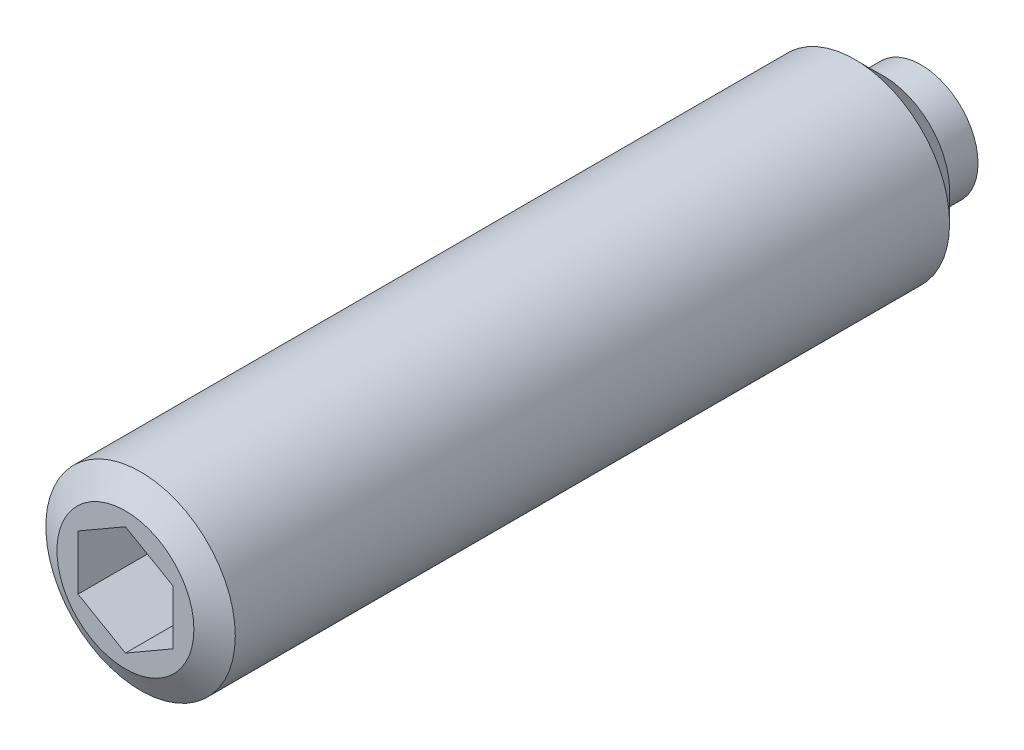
ISO-10303-21;
HEADER;
FILE_DESCRIPTION(('STEP AP214'),'2;1');
FILE_NAME('part.step','',(''),(''),'','','');
FILE_SCHEMA(('AUTOMOTIVE_DESIGN { 1 0 10303 214 1 1 1 1 }'));
ENDSEC;
DATA;
#1=APPLICATION_CONTEXT('core data for automotive mechanical design processes');
#2=APPLICATION_PROTOCOL_DEFINITION('international standard','automotive_design',2000,#1);
#3=PRODUCT_CONTEXT('',#1,'mechanical');
#4=PRODUCT('Part','Part','',(#3));
#5=PRODUCT_RELATED_PRODUCT_CATEGORY('part','',(#4));
#6=PRODUCT_DEFINITION_FORMATION('','',#4);
#7=PRODUCT_DEFINITION_CONTEXT('part definition',#1,'design');
#8=PRODUCT_DEFINITION('design','',#6,#7);
#9=PRODUCT_DEFINITION_SHAPE('','',#8);
#10=(LENGTH_UNIT() NAMED_UNIT(*) SI_UNIT(.MILLI.,.METRE.));
#11=(NAMED_UNIT(*) PLANE_ANGLE_UNIT() SI_UNIT($,.RADIAN.));
#12=(NAMED_UNIT(*) SI_UNIT($,.STERADIAN.) SOLID_ANGLE_UNIT());
#13=UNCERTAINTY_MEASURE_WITH_UNIT(LENGTH_MEASURE(1.E-05),#10,'distance_accuracy_value','');
#14=(GEOMETRIC_REPRESENTATION_CONTEXT(3) GLOBAL_UNCERTAINTY_ASSIGNED_CONTEXT((#13)) GLOBAL_UNIT_ASSIGNED_CONTEXT((#10,
#11,#12)) REPRESENTATION_CONTEXT('',''));
#15=CARTESIAN_POINT('',(0.,0.,0.));
#16=DIRECTION('',(0.,0.,1.));
#17=DIRECTION('',(1.,0.,0.));
#18=AXIS2_PLACEMENT_3D('',#15,#16,#17);
#19=CARTESIAN_POINT('',(3.,0.,0.));
#20=DIRECTION('',(0.,0.,-1.));
#21=DIRECTION('',(-1.,0.,0.));
#22=AXIS2_PLACEMENT_3D('',#19,#20,#21);
#23=PLANE('',#22);
#24=CARTESIAN_POINT('',(0.,0.,0.));
#25=DIRECTION('',(0.,0.,1.));
#26=DIRECTION('',(1.,0.,0.));
#27=AXIS2_PLACEMENT_3D('',#24,#25,#26);
#28=CIRCLE('',#27,3.);
#29=CARTESIAN_POINT('',(3.,0.,0.));
#30=VERTEX_POINT('',#29);
#31=EDGE_CURVE('E124',#30,#30,#28,.T.);
#32=ORIENTED_EDGE('',*,*,#31,.F.);
#33=EDGE_LOOP('',(#32));
#34=FACE_BOUND('',#33,.T.);
#35=ADVANCED_FACE('F14',(#34),#23,.T.);
#36=CARTESIAN_POINT('',(0.,0.,62.));
#37=DIRECTION('',(0.,0.,1.));
#38=DIRECTION('',(1.,0.,0.));
#39=AXIS2_PLACEMENT_3D('',#36,#37,#38);
#40=CYLINDRICAL_SURFACE('',#39,3.);
#41=CARTESIAN_POINT('',(0.,0.,2.));
#42=DIRECTION('',(0.,0.,1.));
#43=DIRECTION('',(1.,0.,0.));
#44=AXIS2_PLACEMENT_3D('',#41,#42,#43);
#45=CIRCLE('',#44,3.);
#46=CARTESIAN_POINT('',(3.,0.,2.));
#47=VERTEX_POINT('',#46);
#48=EDGE_CURVE('E121',#47,#47,#45,.T.);
#49=ORIENTED_EDGE('',*,*,#48,.F.);
#50=EDGE_LOOP('',(#49));
#51=FACE_BOUND('',#50,.T.);
#52=ORIENTED_EDGE('',*,*,#31,.T.);
#53=EDGE_LOOP('',(#52));
#54=FACE_BOUND('',#53,.T.);
#55=ADVANCED_FACE('F149',(#51,#54),#40,.T.);
#56=CARTESIAN_POINT('',(5.,0.,2.));
#57=DIRECTION('',(0.,0.,-1.));
#58=DIRECTION('',(-1.,0.,0.));
#59=AXIS2_PLACEMENT_3D('',#56,#57,#58);
#60=PLANE('',#59);
#61=CARTESIAN_POINT('',(0.,0.,2.));
#62=DIRECTION('',(0.,0.,-1.));
#63=DIRECTION('',(-1.,0.,0.));
#64=AXIS2_PLACEMENT_3D('',#61,#62,#63);
#65=CIRCLE('',#64,3.5);
#66=CARTESIAN_POINT('',(-3.5,0.,2.));
#67=VERTEX_POINT('',#66);
#68=EDGE_CURVE('E130',#67,#67,#65,.T.);
#69=ORIENTED_EDGE('',*,*,#68,.T.);
#70=EDGE_LOOP('',(#69));
#71=FACE_BOUND('',#70,.T.);
#72=ORIENTED_EDGE('',*,*,#48,.T.);
#73=EDGE_LOOP('',(#72));
#74=FACE_BOUND('',#73,.T.);
#75=ADVANCED_FACE('F155',(#71,#74),#60,.T.);
#76=CARTESIAN_POINT('',(0.,0.,62.));
#77=DIRECTION('',(0.,0.,1.));
#78=DIRECTION('',(1.,0.,0.));
#79=AXIS2_PLACEMENT_3D('',#76,#77,#78);
#80=CYLINDRICAL_SURFACE('',#79,5.);
#81=CARTESIAN_POINT('',(0.,0.,41.2));
#82=DIRECTION('',(0.,0.,1.));
#83=DIRECTION('',(1.,0.,0.));
#84=AXIS2_PLACEMENT_3D('',#81,#82,#83);
#85=CIRCLE('',#84,5.);
#86=CARTESIAN_POINT('',(5.,0.,41.2));
#87=VERTEX_POINT('',#86);
#88=EDGE_CURVE('E9',#87,#87,#85,.F.);
#89=ORIENTED_EDGE('',*,*,#88,.T.);
#90=EDGE_LOOP('',(#89));
#91=FACE_BOUND('',#90,.T.);
#92=CARTESIAN_POINT('',(0.,0.,3.5));
#93=DIRECTION('',(0.,0.,-1.));
#94=DIRECTION('',(-1.,0.,0.));
#95=AXIS2_PLACEMENT_3D('',#92,#93,#94);
#96=CIRCLE('',#95,5.);
#97=CARTESIAN_POINT('',(-5.,0.,3.5));
#98=VERTEX_POINT('',#97);
#99=EDGE_CURVE('E127',#98,#98,#96,.F.);
#100=ORIENTED_EDGE('',*,*,#99,.T.);
#101=EDGE_LOOP('',(#100));
#102=FACE_BOUND('',#101,.T.);
#103=ADVANCED_FACE('F162',(#91,#102),#80,.T.);
#104=CARTESIAN_POINT('',(0.,0.,42.));
#105=DIRECTION('',(0.,0.,1.));
#106=DIRECTION('',(1.,0.,0.));
#107=AXIS2_PLACEMENT_3D('',#104,#105,#106);
#108=PLANE('',#107);
#109=CARTESIAN_POINT('',(0.,0.,42.));
#110=DIRECTION('',(0.,0.,1.));
#111=DIRECTION('',(1.,0.,0.));
#112=AXIS2_PLACEMENT_3D('',#109,#110,#111);
#113=CIRCLE('',#112,3.61435935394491);
#114=CARTESIAN_POINT('',(3.61435935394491,0.,42.));
#115=VERTEX_POINT('',#114);
#116=EDGE_CURVE('E22',#115,#115,#113,.T.);
#117=ORIENTED_EDGE('',*,*,#116,.T.);
#118=EDGE_LOOP('',(#117));
#119=FACE_BOUND('',#118,.T.);
#120=DIRECTION('',(0.86602540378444,-0.5,0.));
#121=VECTOR('',#120,1.);
#122=CARTESIAN_POINT('',(-2.5,-1.44337567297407,42.));
#123=LINE('',#122,#121);
#124=CARTESIAN_POINT('',(-2.5,-1.44337567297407,42.));
#125=VERTEX_POINT('',#124);
#126=CARTESIAN_POINT('',(0.,-2.88675134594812,42.));
#127=VERTEX_POINT('',#126);
#128=EDGE_CURVE('E29',#125,#127,#123,.T.);
#129=ORIENTED_EDGE('',*,*,#128,.F.);
#130=DIRECTION('',(0.,-1.,0.));
#131=VECTOR('',#130,1.);
#132=CARTESIAN_POINT('',(-2.5,1.44337567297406,42.));
#133=LINE('',#132,#131);
#134=CARTESIAN_POINT('',(-2.5,1.44337567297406,42.));
#135=VERTEX_POINT('',#134);
#136=EDGE_CURVE('E97',#135,#125,#133,.T.);
#137=ORIENTED_EDGE('',*,*,#136,.F.);
#138=DIRECTION('',(0.866025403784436,0.5,0.));
#139=VECTOR('',#138,1.);
#140=CARTESIAN_POINT('',(-2.5,1.44337567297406,42.));
#141=LINE('',#140,#139);
#142=CARTESIAN_POINT('',(0.,2.88675134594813,42.));
#143=VERTEX_POINT('',#142);
#144=EDGE_CURVE('E92',#135,#143,#141,.T.);
#145=ORIENTED_EDGE('',*,*,#144,.T.);
#146=DIRECTION('',(-0.866025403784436,0.5,0.));
#147=VECTOR('',#146,1.);
#148=CARTESIAN_POINT('',(2.5,1.44337567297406,42.));
#149=LINE('',#148,#147);
#150=CARTESIAN_POINT('',(2.5,1.44337567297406,42.));
#151=VERTEX_POINT('',#150);
#152=EDGE_CURVE('E90',#151,#143,#149,.T.);
#153=ORIENTED_EDGE('',*,*,#152,.F.);
#154=DIRECTION('',(0.,-1.,0.));
#155=VECTOR('',#154,1.);
#156=CARTESIAN_POINT('',(2.5,1.44337567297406,42.));
#157=LINE('',#156,#155);
#158=CARTESIAN_POINT('',(2.5,-1.44337567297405,42.));
#159=VERTEX_POINT('',#158);
#160=EDGE_CURVE('E72',#151,#159,#157,.T.);
#161=ORIENTED_EDGE('',*,*,#160,.T.);
#162=DIRECTION('',(-0.866025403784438,-0.5,0.));
#163=VECTOR('',#162,1.);
#164=CARTESIAN_POINT('',(2.5,-1.44337567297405,42.));
#165=LINE('',#164,#163);
#166=EDGE_CURVE('E83',#159,#127,#165,.T.);
#167=ORIENTED_EDGE('',*,*,#166,.T.);
#168=EDGE_LOOP('',(#129,#137,#145,#153,#161,#167));
#169=FACE_BOUND('',#168,.T.);
#170=ADVANCED_FACE('F87',(#119,#169),#108,.T.);
#171=CARTESIAN_POINT('',(-2.5,-1.44337567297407,38.));
#172=DIRECTION('',(-0.5,-0.86602540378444,0.));
#173=DIRECTION('',(-0.86602540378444,0.5,0.));
#174=AXIS2_PLACEMENT_3D('',#171,#172,#173);
#175=PLANE('',#174);
#176=DIRECTION('',(0.,0.,1.));
#177=VECTOR('',#176,1.);
#178=CARTESIAN_POINT('',(-2.5,-1.44337567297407,38.));
#179=LINE('',#178,#177);
#180=CARTESIAN_POINT('',(-2.5,-1.44337567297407,38.));
#181=VERTEX_POINT('',#180);
#182=EDGE_CURVE('E36',#181,#125,#179,.T.);
#183=ORIENTED_EDGE('',*,*,#182,.T.);
#184=ORIENTED_EDGE('',*,*,#128,.T.);
#185=DIRECTION('',(0.,0.,1.));
#186=VECTOR('',#185,1.);
#187=CARTESIAN_POINT('',(0.,-2.88675134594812,38.));
#188=LINE('',#187,#186);
#189=CARTESIAN_POINT('',(0.,-2.88675134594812,38.));
#190=VERTEX_POINT('',#189);
#191=EDGE_CURVE('E80',#190,#127,#188,.T.);
#192=ORIENTED_EDGE('',*,*,#191,.F.);
#193=DIRECTION('',(0.86602540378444,-0.5,0.));
#194=VECTOR('',#193,1.);
#195=CARTESIAN_POINT('',(-2.5,-1.44337567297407,38.));
#196=LINE('',#195,#194);
#197=EDGE_CURVE('E99',#181,#190,#196,.T.);
#198=ORIENTED_EDGE('',*,*,#197,.F.);
#199=EDGE_LOOP('',(#183,#184,#192,#198));
#200=FACE_BOUND('',#199,.T.);
#201=ADVANCED_FACE('F169',(#200),#175,.F.);
#202=CARTESIAN_POINT('',(-2.5,1.44337567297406,38.));
#203=DIRECTION('',(-1.,0.,0.));
#204=DIRECTION('',(0.,1.,0.));
#205=AXIS2_PLACEMENT_3D('',#202,#203,#204);
#206=PLANE('',#205);
#207=DIRECTION('',(0.,0.,1.));
#208=VECTOR('',#207,1.);
#209=CARTESIAN_POINT('',(-2.5,1.44337567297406,38.));
#210=LINE('',#209,#208);
#211=CARTESIAN_POINT('',(-2.5,1.44337567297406,38.));
#212=VERTEX_POINT('',#211);
#213=EDGE_CURVE('E118',#212,#135,#210,.T.);
#214=ORIENTED_EDGE('',*,*,#213,.T.);
#215=ORIENTED_EDGE('',*,*,#136,.T.);
#216=ORIENTED_EDGE('',*,*,#182,.F.);
#217=DIRECTION('',(0.,-1.,0.));
#218=VECTOR('',#217,1.);
#219=CARTESIAN_POINT('',(-2.5,1.44337567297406,38.));
#220=LINE('',#219,#218);
#221=EDGE_CURVE('E111',#212,#181,#220,.T.);
#222=ORIENTED_EDGE('',*,*,#221,.F.);
#223=EDGE_LOOP('',(#214,#215,#216,#222));
#224=FACE_BOUND('',#223,.T.);
#225=ADVANCED_FACE('F170',(#224),#206,.F.);
#226=CARTESIAN_POINT('',(-2.5,1.44337567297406,38.));
#227=DIRECTION('',(0.5,-0.866025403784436,0.));
#228=DIRECTION('',(-0.866025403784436,-0.5,0.));
#229=AXIS2_PLACEMENT_3D('',#226,#227,#228);
#230=PLANE('',#229);
#231=DIRECTION('',(0.,0.,1.));
#232=VECTOR('',#231,1.);
#233=CARTESIAN_POINT('',(0.,2.88675134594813,38.));
#234=LINE('',#233,#232);
#235=CARTESIAN_POINT('',(0.,2.88675134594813,38.));
#236=VERTEX_POINT('',#235);
#237=EDGE_CURVE('E116',#236,#143,#234,.T.);
#238=ORIENTED_EDGE('',*,*,#237,.T.);
#239=ORIENTED_EDGE('',*,*,#144,.F.);
#240=ORIENTED_EDGE('',*,*,#213,.F.);
#241=DIRECTION('',(0.866025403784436,0.5,0.));
#242=VECTOR('',#241,1.);
#243=CARTESIAN_POINT('',(-2.5,1.44337567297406,38.));
#244=LINE('',#243,#242);
#245=EDGE_CURVE('E108',#212,#236,#244,.T.);
#246=ORIENTED_EDGE('',*,*,#245,.T.);
#247=EDGE_LOOP('',(#238,#239,#240,#246));
#248=FACE_BOUND('',#247,.T.);
#249=ADVANCED_FACE('F173',(#248),#230,.T.);
#250=CARTESIAN_POINT('',(2.5,1.44337567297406,38.));
#251=DIRECTION('',(0.5,0.866025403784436,0.));
#252=DIRECTION('',(0.866025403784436,-0.5,0.));
#253=AXIS2_PLACEMENT_3D('',#250,#251,#252);
#254=PLANE('',#253);
#255=DIRECTION('',(0.,0.,1.));
#256=VECTOR('',#255,1.);
#257=CARTESIAN_POINT('',(2.5,1.44337567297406,38.));
#258=LINE('',#257,#256);
#259=CARTESIAN_POINT('',(2.5,1.44337567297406,38.));
#260=VERTEX_POINT('',#259);
#261=EDGE_CURVE('E79',#260,#151,#258,.T.);
#262=ORIENTED_EDGE('',*,*,#261,.T.);
#263=ORIENTED_EDGE('',*,*,#152,.T.);
#264=ORIENTED_EDGE('',*,*,#237,.F.);
#265=DIRECTION('',(-0.866025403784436,0.5,0.));
#266=VECTOR('',#265,1.);
#267=CARTESIAN_POINT('',(2.5,1.44337567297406,38.));
#268=LINE('',#267,#266);
#269=EDGE_CURVE('E105',#260,#236,#268,.T.);
#270=ORIENTED_EDGE('',*,*,#269,.F.);
#271=EDGE_LOOP('',(#262,#263,#264,#270));
#272=FACE_BOUND('',#271,.T.);
#273=ADVANCED_FACE('F176',(#272),#254,.F.);
#274=CARTESIAN_POINT('',(2.5,1.44337567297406,38.));
#275=DIRECTION('',(-1.,0.,0.));
#276=DIRECTION('',(0.,1.,0.));
#277=AXIS2_PLACEMENT_3D('',#274,#275,#276);
#278=PLANE('',#277);
#279=DIRECTION('',(0.,0.,1.));
#280=VECTOR('',#279,1.);
#281=CARTESIAN_POINT('',(2.5,-1.44337567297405,38.));
#282=LINE('',#281,#280);
#283=CARTESIAN_POINT('',(2.5,-1.44337567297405,38.));
#284=VERTEX_POINT('',#283);
#285=EDGE_CURVE('E68',#284,#159,#282,.T.);
#286=ORIENTED_EDGE('',*,*,#285,.T.);
#287=ORIENTED_EDGE('',*,*,#160,.F.);
#288=ORIENTED_EDGE('',*,*,#261,.F.);
#289=DIRECTION('',(0.,-1.,0.));
#290=VECTOR('',#289,1.);
#291=CARTESIAN_POINT('',(2.5,1.44337567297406,38.));
#292=LINE('',#291,#290);
#293=EDGE_CURVE('E75',#260,#284,#292,.T.);
#294=ORIENTED_EDGE('',*,*,#293,.T.);
#295=EDGE_LOOP('',(#286,#287,#288,#294));
#296=FACE_BOUND('',#295,.T.);
#297=ADVANCED_FACE('F70',(#296),#278,.T.);
#298=CARTESIAN_POINT('',(2.5,-1.44337567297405,38.));
#299=DIRECTION('',(-0.5,0.866025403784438,0.));
#300=DIRECTION('',(0.866025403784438,0.5,0.));
#301=AXIS2_PLACEMENT_3D('',#298,#299,#300);
#302=PLANE('',#301);
#303=DIRECTION('',(-0.866025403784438,-0.5,0.));
#304=VECTOR('',#303,1.);
#305=CARTESIAN_POINT('',(2.5,-1.44337567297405,38.));
#306=LINE('',#305,#304);
#307=EDGE_CURVE('E102',#284,#190,#306,.T.);
#308=ORIENTED_EDGE('',*,*,#307,.T.);
#309=ORIENTED_EDGE('',*,*,#191,.T.);
#310=ORIENTED_EDGE('',*,*,#166,.F.);
#311=ORIENTED_EDGE('',*,*,#285,.F.);
#312=EDGE_LOOP('',(#308,#309,#310,#311));
#313=FACE_BOUND('',#312,.T.);
#314=ADVANCED_FACE('F84',(#313),#302,.T.);
#315=CARTESIAN_POINT('',(2.5,-4.33012701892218,38.));
#316=DIRECTION('',(0.,0.,-1.));
#317=DIRECTION('',(-1.,0.,0.));
#318=AXIS2_PLACEMENT_3D('',#315,#316,#317);
#319=PLANE('',#318);
#320=ORIENTED_EDGE('',*,*,#197,.T.);
#321=ORIENTED_EDGE('',*,*,#307,.F.);
#322=ORIENTED_EDGE('',*,*,#293,.F.);
#323=ORIENTED_EDGE('',*,*,#269,.T.);
#324=ORIENTED_EDGE('',*,*,#245,.F.);
#325=ORIENTED_EDGE('',*,*,#221,.T.);
#326=EDGE_LOOP('',(#320,#321,#322,#323,#324,#325));
#327=FACE_BOUND('',#326,.T.);
#328=ADVANCED_FACE('F144',(#327),#319,.F.);
#329=CARTESIAN_POINT('',(0.,0.,3.5));
#330=DIRECTION('',(0.,0.,1.));
#331=DIRECTION('',(1.,0.,0.));
#332=AXIS2_PLACEMENT_3D('',#329,#330,#331);
#333=CONICAL_SURFACE('',#332,5.,0.785398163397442);
#334=ORIENTED_EDGE('',*,*,#68,.F.);
#335=EDGE_LOOP('',(#334));
#336=FACE_BOUND('',#335,.T.);
#337=ORIENTED_EDGE('',*,*,#99,.F.);
#338=EDGE_LOOP('',(#337));
#339=FACE_BOUND('',#338,.T.);
#340=ADVANCED_FACE('F137',(#336,#339),#333,.T.);
#341=CARTESIAN_POINT('',(0.,0.,42.));
#342=DIRECTION('',(0.,0.,-1.));
#343=DIRECTION('',(-1.,0.,0.));
#344=AXIS2_PLACEMENT_3D('',#341,#342,#343);
#345=CONICAL_SURFACE('',#344,3.61435935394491,1.0471975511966);
#346=ORIENTED_EDGE('',*,*,#88,.F.);
#347=EDGE_LOOP('',(#346));
#348=FACE_BOUND('',#347,.T.);
#349=ORIENTED_EDGE('',*,*,#116,.F.);
#350=EDGE_LOOP('',(#349));
#351=FACE_BOUND('',#350,.T.);
#352=ADVANCED_FACE('F16',(#348,#351),#345,.T.);
#353=CLOSED_SHELL('',(#35,#55,#75,#103,#170,#201,#225,#249,#273,#297,#314,#328,#340,#352));
#354=MANIFOLD_SOLID_BREP('B1',#353);
#355=ADVANCED_BREP_SHAPE_REPRESENTATION('',(#18,#354),#14);
#356=SHAPE_DEFINITION_REPRESENTATION(#9,#355);
ENDSEC;
END-ISO-10303-21;
